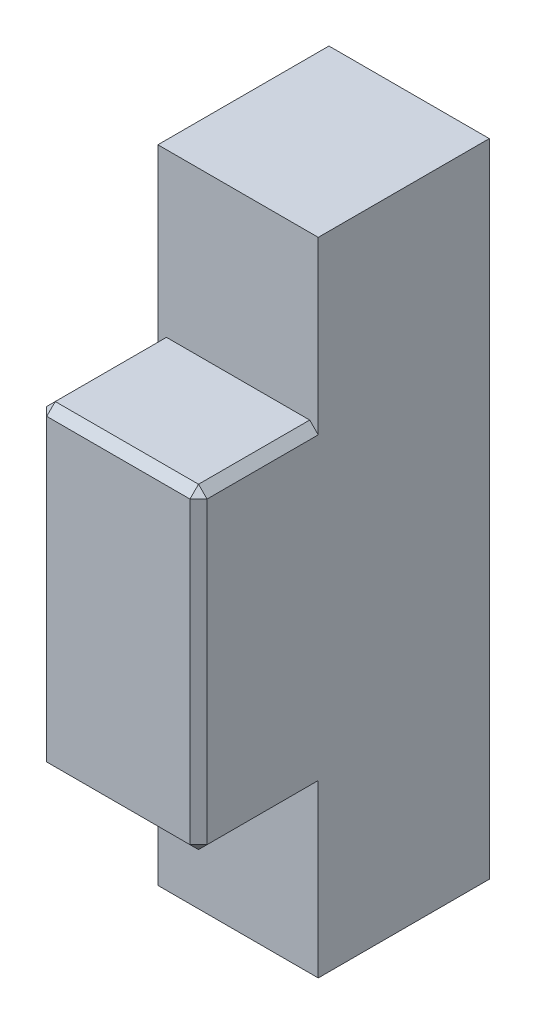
from build123d import *

# Parameters (mm, degrees)
SKETCH1_W           = 9.525
SKETCH1_H           = 38.1
BASE_EXTRUDE_DEPTH  = 10.16
SKETCH2_W           = 9.525
SKETCH2_H           = 18.796
BOSS_EXTRUDE1_DEPTH = 7.112
CHAMFER1_SIZE       = 0.508


with BuildPart() as part:
    # Sketch1 → Base-Extrude (new body)
    with BuildSketch(Plane.XY):
        with Locations((646.057266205, 0)):
            Rectangle(SKETCH1_W, SKETCH1_H)
    extrude(amount=BASE_EXTRUDE_DEPTH)

    # Sketch2 → Boss-Extrude1 (add)
    with BuildSketch(Plane.XY.offset(10.16)):
        with Locations((646.057266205, 0)):
            Rectangle(SKETCH2_W, SKETCH2_H)
    extrude(amount=BOSS_EXTRUDE1_DEPTH)

    # Chamfer1
    chamfer1_edges = [part.edges().sort_by_distance(p)[0] for p in [
        (641.294766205, 9.398, 13.716),
        (641.294766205, 0, 17.272),
        (641.294766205, -9.398, 13.716),
        (650.819766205, -9.398, 13.716),
        (650.819766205, 0, 17.272),
        (650.819766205, 9.398, 13.716),
        (646.057266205, 9.398, 17.272),
        (646.057266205, -9.398, 17.272),
    ]]
    chamfer(chamfer1_edges, length=CHAMFER1_SIZE)


solid = part.part
